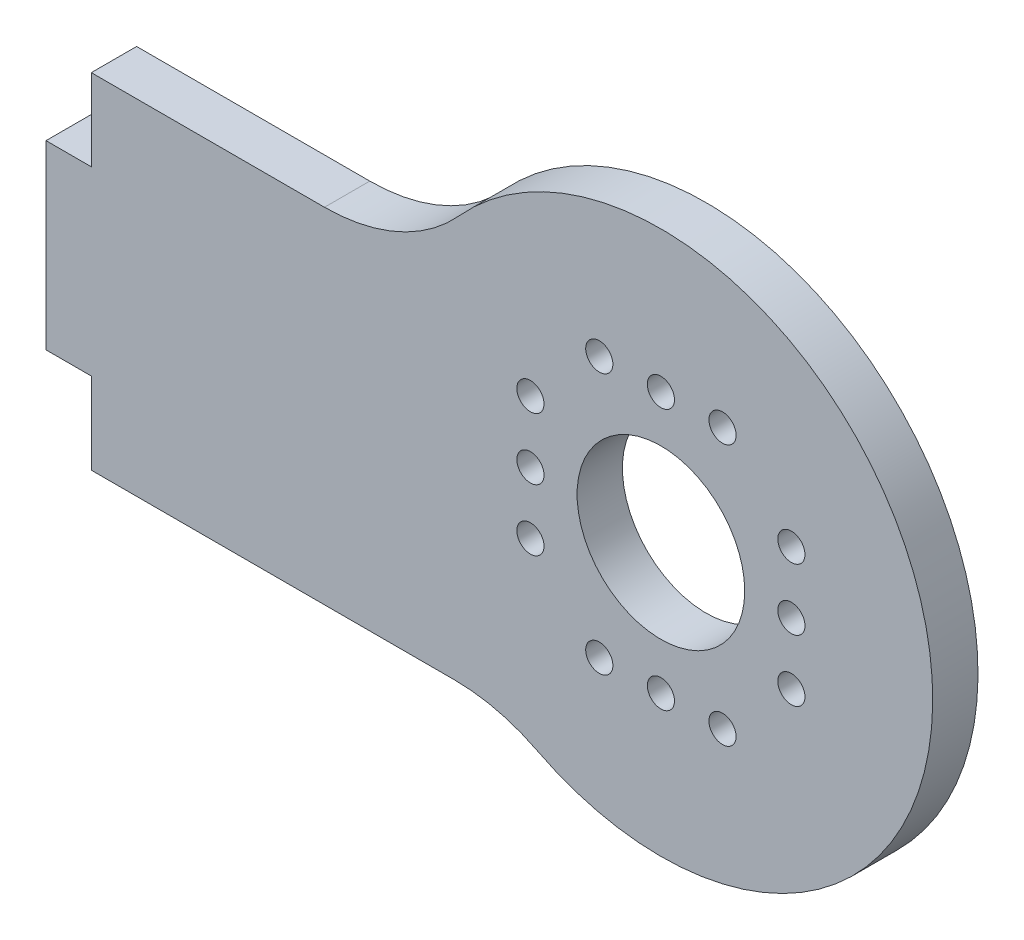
from build123d import *

# Parameters (mm, degrees)
SKETCH2_R           = 0.75
SKETCH2_R_2         = 4.625
BOSS_EXTRUDE1_DEPTH = 2.5


with BuildPart() as part:
    # Sketch2 → Boss-Extrude1 (new body)
    with BuildSketch(Plane.XY):
        with BuildLine():
            Line((-31.431783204, -7.755458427), (-31.431783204, -12.255458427))
            Line((-31.431783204, -12.255458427), (-11.388352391, -12.255458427))
            ThreePointArc((-11.388352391, -12.255458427), (-9.045473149, -12.533785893), (-6.833011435, -13.353275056))
            ThreePointArc((-6.833011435, -13.353275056), (14.752377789, 2.714286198), (-11.138371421, 10.046724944))
            ThreePointArc((-11.138371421, 10.046724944), (-14.500589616, 7.607305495), (-18.563952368, 6.744541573))
            Line((-18.563952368, 6.744541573), (-31.431783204, 6.744541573))
            Line((-31.431783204, 6.744541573), (-31.431783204, 2.244541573))
            Line((-31.431783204, 2.244541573), (-33.931783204, 2.244541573))
            Line((-33.931783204, 2.244541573), (-33.931783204, -7.755458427))
            Line((-33.931783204, -7.755458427), (-31.431783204, -7.755458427))
        make_face()
        with Locations((0, -7.2)):
            Circle(SKETCH2_R, mode=Mode.SUBTRACT)
        with Locations((-7.2, 0)):
            Circle(SKETCH2_R, mode=Mode.SUBTRACT)
        with Locations((7.2, 0)):
            Circle(SKETCH2_R, mode=Mode.SUBTRACT)
        with Locations((0, 7.2)):
            Circle(SKETCH2_R, mode=Mode.SUBTRACT)
        with Locations((3.4, -7.2)):
            Circle(SKETCH2_R, mode=Mode.SUBTRACT)
        with Locations((-3.4, -7.2)):
            Circle(SKETCH2_R, mode=Mode.SUBTRACT)
        with Locations((-7.2, -3.4)):
            Circle(SKETCH2_R, mode=Mode.SUBTRACT)
        with Locations((-7.2, 3.4)):
            Circle(SKETCH2_R, mode=Mode.SUBTRACT)
        with Locations((-3.4, 7.2)):
            Circle(SKETCH2_R, mode=Mode.SUBTRACT)
        with Locations((3.4, 7.2)):
            Circle(SKETCH2_R, mode=Mode.SUBTRACT)
        with Locations((7.2, 3.4)):
            Circle(SKETCH2_R, mode=Mode.SUBTRACT)
        with Locations((7.2, -3.4)):
            Circle(SKETCH2_R, mode=Mode.SUBTRACT)
        Circle(SKETCH2_R_2, mode=Mode.SUBTRACT)
    extrude(amount=BOSS_EXTRUDE1_DEPTH)


solid = part.part
